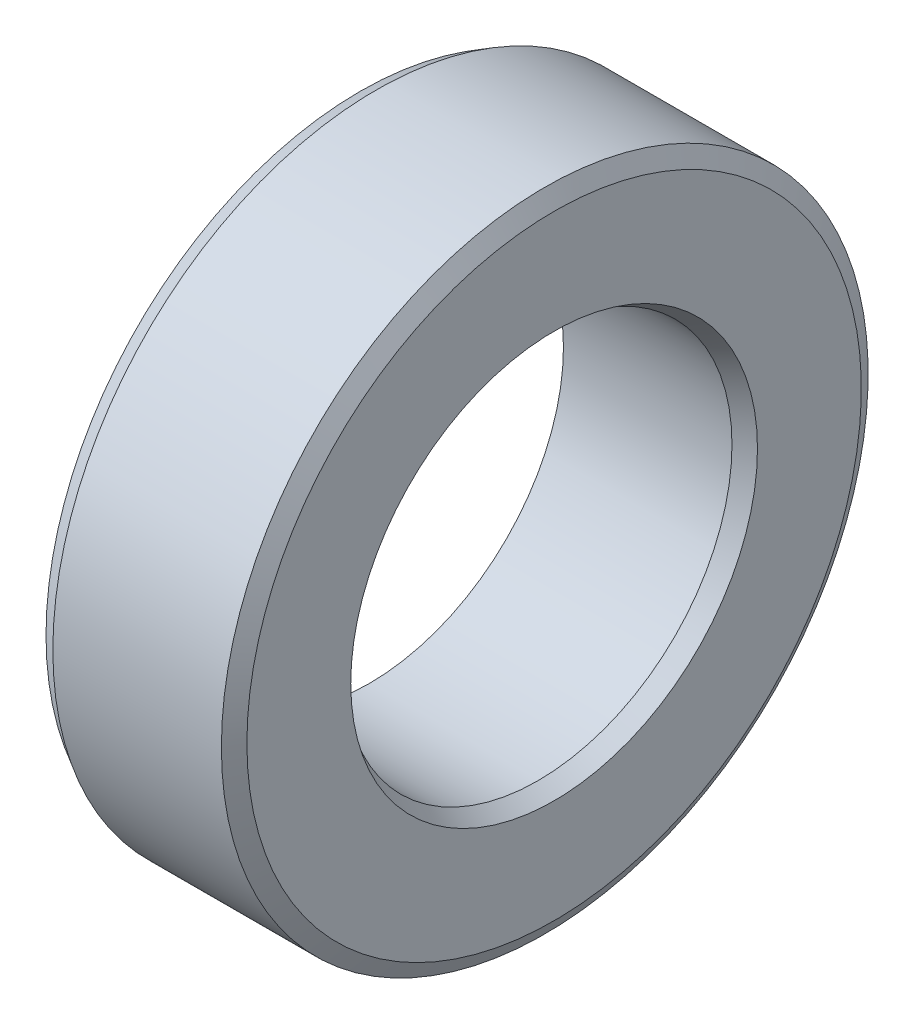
ISO-10303-21;
HEADER;
FILE_DESCRIPTION(('STEP AP214'),'2;1');
FILE_NAME('part.step','',(''),(''),'','','');
FILE_SCHEMA(('AUTOMOTIVE_DESIGN { 1 0 10303 214 1 1 1 1 }'));
ENDSEC;
DATA;
#1=APPLICATION_CONTEXT('core data for automotive mechanical design processes');
#2=APPLICATION_PROTOCOL_DEFINITION('international standard','automotive_design',2000,#1);
#3=PRODUCT_CONTEXT('',#1,'mechanical');
#4=PRODUCT('Part','Part','',(#3));
#5=PRODUCT_RELATED_PRODUCT_CATEGORY('part','',(#4));
#6=PRODUCT_DEFINITION_FORMATION('','',#4);
#7=PRODUCT_DEFINITION_CONTEXT('part definition',#1,'design');
#8=PRODUCT_DEFINITION('design','',#6,#7);
#9=PRODUCT_DEFINITION_SHAPE('','',#8);
#10=(LENGTH_UNIT() NAMED_UNIT(*) SI_UNIT(.MILLI.,.METRE.));
#11=(NAMED_UNIT(*) PLANE_ANGLE_UNIT() SI_UNIT($,.RADIAN.));
#12=(NAMED_UNIT(*) SI_UNIT($,.STERADIAN.) SOLID_ANGLE_UNIT());
#13=UNCERTAINTY_MEASURE_WITH_UNIT(LENGTH_MEASURE(1.E-05),#10,'distance_accuracy_value','');
#14=(GEOMETRIC_REPRESENTATION_CONTEXT(3) GLOBAL_UNCERTAINTY_ASSIGNED_CONTEXT((#13)) GLOBAL_UNIT_ASSIGNED_CONTEXT((#10,
#11,#12)) REPRESENTATION_CONTEXT('',''));
#15=CARTESIAN_POINT('',(0.,0.,0.));
#16=DIRECTION('',(0.,0.,1.));
#17=DIRECTION('',(1.,0.,0.));
#18=AXIS2_PLACEMENT_3D('',#15,#16,#17);
#19=CARTESIAN_POINT('',(-1.5,5.,0.));
#20=DIRECTION('',(1.,0.,0.));
#21=DIRECTION('',(0.,0.,-1.));
#22=AXIS2_PLACEMENT_3D('',#19,#20,#21);
#23=PLANE('',#22);
#24=CARTESIAN_POINT('',(-1.5,0.,0.));
#25=DIRECTION('',(1.,0.,0.));
#26=DIRECTION('',(0.,0.,-1.));
#27=AXIS2_PLACEMENT_3D('',#24,#25,#26);
#28=CIRCLE('',#27,3.25);
#29=CARTESIAN_POINT('',(-1.5,0.,-3.25));
#30=VERTEX_POINT('',#29);
#31=EDGE_CURVE('E33',#30,#30,#28,.T.);
#32=ORIENTED_EDGE('',*,*,#31,.T.);
#33=EDGE_LOOP('',(#32));
#34=FACE_BOUND('',#33,.T.);
#35=CARTESIAN_POINT('',(-1.5,0.,0.));
#36=DIRECTION('',(1.,0.,0.));
#37=DIRECTION('',(0.,0.,-1.));
#38=AXIS2_PLACEMENT_3D('',#35,#36,#37);
#39=CIRCLE('',#38,4.85566243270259);
#40=CARTESIAN_POINT('',(-1.5,0.,-4.85566243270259));
#41=VERTEX_POINT('',#40);
#42=EDGE_CURVE('E36',#41,#41,#39,.F.);
#43=ORIENTED_EDGE('',*,*,#42,.T.);
#44=EDGE_LOOP('',(#43));
#45=FACE_BOUND('',#44,.T.);
#46=ADVANCED_FACE('F14',(#34,#45),#23,.F.);
#47=CARTESIAN_POINT('',(-41.6324503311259,0.,0.));
#48=DIRECTION('',(-1.,0.,0.));
#49=DIRECTION('',(0.,0.,1.));
#50=AXIS2_PLACEMENT_3D('',#47,#48,#49);
#51=CYLINDRICAL_SURFACE('',#50,3.);
#52=CARTESIAN_POINT('',(-1.3556624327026,0.,0.));
#53=DIRECTION('',(1.,0.,0.));
#54=DIRECTION('',(0.,0.,-1.));
#55=AXIS2_PLACEMENT_3D('',#52,#53,#54);
#56=CIRCLE('',#55,3.);
#57=CARTESIAN_POINT('',(-1.3556624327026,0.,-3.));
#58=VERTEX_POINT('',#57);
#59=EDGE_CURVE('E39',#58,#58,#56,.F.);
#60=ORIENTED_EDGE('',*,*,#59,.T.);
#61=EDGE_LOOP('',(#60));
#62=FACE_BOUND('',#61,.T.);
#63=CARTESIAN_POINT('',(1.25,0.,0.));
#64=DIRECTION('',(-1.,0.,0.));
#65=DIRECTION('',(0.,0.,1.));
#66=AXIS2_PLACEMENT_3D('',#63,#64,#65);
#67=CIRCLE('',#66,3.);
#68=CARTESIAN_POINT('',(1.25,0.,3.));
#69=VERTEX_POINT('',#68);
#70=EDGE_CURVE('E42',#69,#69,#67,.F.);
#71=ORIENTED_EDGE('',*,*,#70,.T.);
#72=EDGE_LOOP('',(#71));
#73=FACE_BOUND('',#72,.T.);
#74=ADVANCED_FACE('F46',(#62,#73),#51,.F.);
#75=CARTESIAN_POINT('',(1.5,5.,0.));
#76=DIRECTION('',(-1.,0.,0.));
#77=DIRECTION('',(0.,0.,1.));
#78=AXIS2_PLACEMENT_3D('',#75,#76,#77);
#79=PLANE('',#78);
#80=CARTESIAN_POINT('',(1.5,0.,0.));
#81=DIRECTION('',(-1.,0.,0.));
#82=DIRECTION('',(0.,0.,1.));
#83=AXIS2_PLACEMENT_3D('',#80,#81,#82);
#84=CIRCLE('',#83,3.1443375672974);
#85=CARTESIAN_POINT('',(1.5,0.,3.1443375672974));
#86=VERTEX_POINT('',#85);
#87=EDGE_CURVE('E24',#86,#86,#84,.T.);
#88=ORIENTED_EDGE('',*,*,#87,.T.);
#89=EDGE_LOOP('',(#88));
#90=FACE_BOUND('',#89,.T.);
#91=CARTESIAN_POINT('',(1.5,0.,0.));
#92=DIRECTION('',(-1.,0.,0.));
#93=DIRECTION('',(0.,0.,1.));
#94=AXIS2_PLACEMENT_3D('',#91,#92,#93);
#95=CIRCLE('',#94,4.75);
#96=CARTESIAN_POINT('',(1.5,0.,4.75));
#97=VERTEX_POINT('',#96);
#98=EDGE_CURVE('E28',#97,#97,#95,.F.);
#99=ORIENTED_EDGE('',*,*,#98,.T.);
#100=EDGE_LOOP('',(#99));
#101=FACE_BOUND('',#100,.T.);
#102=ADVANCED_FACE('F56',(#90,#101),#79,.F.);
#103=CARTESIAN_POINT('',(-41.6324503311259,0.,0.));
#104=DIRECTION('',(-1.,0.,0.));
#105=DIRECTION('',(0.,0.,1.));
#106=AXIS2_PLACEMENT_3D('',#103,#104,#105);
#107=CYLINDRICAL_SURFACE('',#106,5.);
#108=CARTESIAN_POINT('',(1.3556624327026,0.,0.));
#109=DIRECTION('',(-1.,0.,0.));
#110=DIRECTION('',(0.,0.,1.));
#111=AXIS2_PLACEMENT_3D('',#108,#109,#110);
#112=CIRCLE('',#111,5.);
#113=CARTESIAN_POINT('',(1.3556624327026,0.,5.));
#114=VERTEX_POINT('',#113);
#115=EDGE_CURVE('E9',#114,#114,#112,.T.);
#116=ORIENTED_EDGE('',*,*,#115,.T.);
#117=EDGE_LOOP('',(#116));
#118=FACE_BOUND('',#117,.T.);
#119=CARTESIAN_POINT('',(-1.25,0.,0.));
#120=DIRECTION('',(1.,0.,0.));
#121=DIRECTION('',(0.,0.,-1.));
#122=AXIS2_PLACEMENT_3D('',#119,#120,#121);
#123=CIRCLE('',#122,5.);
#124=CARTESIAN_POINT('',(-1.25,0.,-5.));
#125=VERTEX_POINT('',#124);
#126=EDGE_CURVE('E20',#125,#125,#123,.T.);
#127=ORIENTED_EDGE('',*,*,#126,.T.);
#128=EDGE_LOOP('',(#127));
#129=FACE_BOUND('',#128,.T.);
#130=ADVANCED_FACE('F59',(#118,#129),#107,.T.);
#131=CARTESIAN_POINT('',(-1.3556624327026,0.,0.));
#132=DIRECTION('',(-1.,0.,0.));
#133=DIRECTION('',(0.,0.,1.));
#134=AXIS2_PLACEMENT_3D('',#131,#132,#133);
#135=CONICAL_SURFACE('',#134,3.,1.0471975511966);
#136=ORIENTED_EDGE('',*,*,#31,.F.);
#137=EDGE_LOOP('',(#136));
#138=FACE_BOUND('',#137,.T.);
#139=ORIENTED_EDGE('',*,*,#59,.F.);
#140=EDGE_LOOP('',(#139));
#141=FACE_BOUND('',#140,.T.);
#142=ADVANCED_FACE('F52',(#138,#141),#135,.F.);
#143=CARTESIAN_POINT('',(1.5,0.,0.));
#144=DIRECTION('',(1.,0.,0.));
#145=DIRECTION('',(0.,0.,-1.));
#146=AXIS2_PLACEMENT_3D('',#143,#144,#145);
#147=CONICAL_SURFACE('',#146,3.1443375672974,0.523598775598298);
#148=ORIENTED_EDGE('',*,*,#70,.F.);
#149=EDGE_LOOP('',(#148));
#150=FACE_BOUND('',#149,.T.);
#151=ORIENTED_EDGE('',*,*,#87,.F.);
#152=EDGE_LOOP('',(#151));
#153=FACE_BOUND('',#152,.T.);
#154=ADVANCED_FACE('F48',(#150,#153),#147,.F.);
#155=CARTESIAN_POINT('',(1.3556624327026,0.,0.));
#156=DIRECTION('',(-1.,0.,0.));
#157=DIRECTION('',(0.,0.,1.));
#158=AXIS2_PLACEMENT_3D('',#155,#156,#157);
#159=CONICAL_SURFACE('',#158,5.,1.0471975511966);
#160=ORIENTED_EDGE('',*,*,#98,.F.);
#161=EDGE_LOOP('',(#160));
#162=FACE_BOUND('',#161,.T.);
#163=ORIENTED_EDGE('',*,*,#115,.F.);
#164=EDGE_LOOP('',(#163));
#165=FACE_BOUND('',#164,.T.);
#166=ADVANCED_FACE('F51',(#162,#165),#159,.T.);
#167=CARTESIAN_POINT('',(-1.5,0.,0.));
#168=DIRECTION('',(1.,0.,0.));
#169=DIRECTION('',(0.,0.,-1.));
#170=AXIS2_PLACEMENT_3D('',#167,#168,#169);
#171=CONICAL_SURFACE('',#170,4.85566243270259,0.523598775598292);
#172=ORIENTED_EDGE('',*,*,#126,.F.);
#173=EDGE_LOOP('',(#172));
#174=FACE_BOUND('',#173,.T.);
#175=ORIENTED_EDGE('',*,*,#42,.F.);
#176=EDGE_LOOP('',(#175));
#177=FACE_BOUND('',#176,.T.);
#178=ADVANCED_FACE('F65',(#174,#177),#171,.T.);
#179=CLOSED_SHELL('',(#46,#74,#102,#130,#142,#154,#166,#178));
#180=MANIFOLD_SOLID_BREP('B1',#179);
#181=ADVANCED_BREP_SHAPE_REPRESENTATION('',(#18,#180),#14);
#182=SHAPE_DEFINITION_REPRESENTATION(#9,#181);
ENDSEC;
END-ISO-10303-21;
